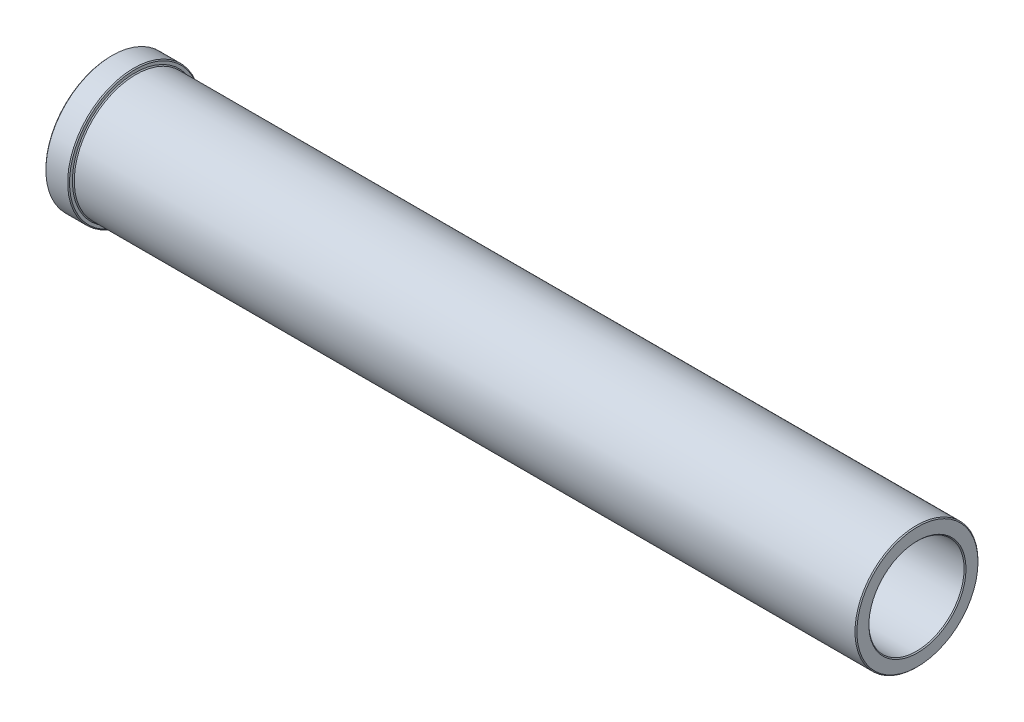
from build123d import *


with BuildPart() as part:
    # Esquisse1 → R_volution1 (revolve)
    with BuildSketch(Plane.XY, mode=Mode.PRIVATE) as r_volution1_sk:
        Polygon((0, 51.3), (0, 64), (-1, 65), (-826, 65), (-827, 66), (-827, 69), (-828, 70), (-851, 70), (-852, 69), (-852, 55), (-851, 54), (-123, 54), (-122, 53), (-122, 51.3), (-121, 50.3), (-1, 50.3), align=None)
    revolve(r_volution1_sk.sketch.rotate(Axis((38.36445352, 0, 0), (-1, 0, 0)), 90), axis=Axis((38.36445352, 0, 0), (-1, 0, 0)))


solid = part.part
